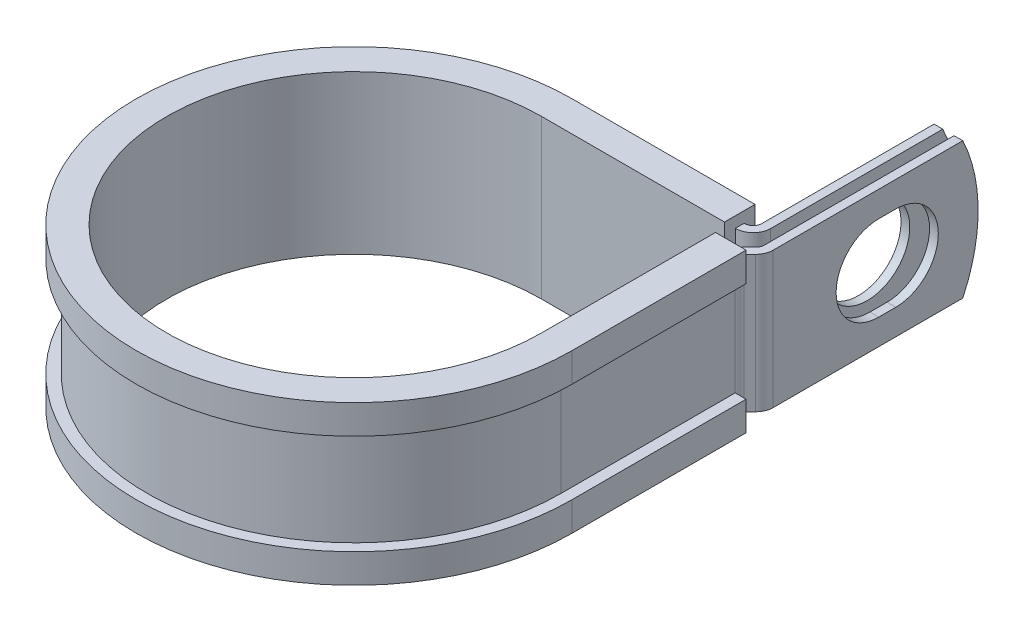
from build123d import *

# Parameters (mm, degrees)
EXTRUDE_THIN1_DEPTH = 9.525
SKETCH2_R           = 5.9436
CUT_EXTRUDE1_DEPTH  = 1.2192
CUT_EXTRUDE2_DEPTH  = 1.2192
CUT_EXTRUDE3_DEPTH  = 80.825829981


with BuildPart() as part:
    # Sketch1 → Extrude-Thin1 (new, symmetric)
    with BuildSketch(Plane(origin=(0, 0, 0), x_dir=(1, 0, 0), z_dir=(0, 1, 0))):
        with BuildLine():
            Line((29.6088698, 56.3372), (29.6088698, 27.7114))
            ThreePointArc((29.6088698, 27.7114), (29.516063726, 27.244832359), (29.251774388, 26.849295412))
            Line((29.251774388, 26.849295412), (28.425590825, 26.023111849))
            ThreePointArc((28.425590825, 26.023111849), (27.897012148, 25.232037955), (27.7114, 24.298902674))
            Line((27.7114, 24.298902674), (27.7114, 0))
            ThreePointArc((27.7114, 0), (-19.594918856, -19.594918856), (0, 27.7114))
            Line((0, 27.7114), (25.5956698, 27.7114))
            ThreePointArc((25.5956698, 27.7114), (27.319878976, 28.425590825), (28.0340698, 30.1498))
            Line((28.0340698, 30.1498), (28.0340698, 56.3372))
            Line((28.0340698, 56.3372), (26.8148698, 56.3372))
            Line((26.8148698, 56.3372), (26.8148698, 30.1498))
            ThreePointArc((26.8148698, 30.1498), (26.457774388, 29.287695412), (25.5956698, 28.9306))
            Line((25.5956698, 28.9306), (0, 28.9306))
            ThreePointArc((0, 28.9306), (-20.457023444, -20.457023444), (28.9306, 0))
            Line((28.9306, 0), (28.9306, 24.298902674))
            ThreePointArc((28.9306, 24.298902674), (29.023406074, 24.765470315), (29.287695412, 25.161007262))
            Line((29.287695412, 25.161007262), (30.113878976, 25.987190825))
            ThreePointArc((30.113878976, 25.987190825), (30.642457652, 26.778264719), (30.8280698, 27.7114))
            Line((30.8280698, 27.7114), (30.8280698, 56.3372))
            Line((30.8280698, 56.3372), (29.6088698, 56.3372))
        make_face()
    extrude(amount=EXTRUDE_THIN1_DEPTH, both=True)

    # Sketch2 → Cut-Extrude1 (cut)
    with BuildSketch(Plane.ZY.offset(-26.8148698)):
        with Locations((-43.6372, 0)):
            Circle(SKETCH2_R)
    extrude(amount=-CUT_EXTRUDE1_DEPTH, mode=Mode.SUBTRACT)

    # Sketch3 → Cut-Extrude2 (cut)
    with BuildSketch(Plane(origin=(30.8280698, 0, 0), x_dir=(0, 0, -1), z_dir=(1, 0, 0))):
        with BuildLine():
            Line((42.4434, 5.9436), (44.831, 5.9436))
            ThreePointArc((44.831, 5.9436), (50.7746, 0), (44.831, -5.9436))
            Line((44.831, -5.9436), (42.4434, -5.9436))
            ThreePointArc((42.4434, -5.9436), (36.4998, 0), (42.4434, 5.9436))
        make_face()
    extrude(amount=-CUT_EXTRUDE2_DEPTH, mode=Mode.SUBTRACT)

    # Sketch4 → Cut-Extrude3 (cut, through all)
    with BuildSketch(Plane.ZY.offset(-26.8148698)):
        with BuildLine():
            Line((-54.192663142, 9.525), (-56.3372, 9.525))
            Line((-56.3372, 9.525), (-56.3372, -2.73e-07))
            ThreePointArc((-56.3372, -2.73e-07), (-55.794438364, 4.881717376), (-54.192663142, 9.525))
        make_face()
        with BuildLine():
            ThreePointArc((-54.192663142, -9.525), (-55.794438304, -4.881717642), (-56.3372, -2.73e-07))
            Line((-56.3372, -2.73e-07), (-56.3372, -9.525))
            Line((-56.3372, -9.525), (-54.192663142, -9.525))
        make_face()
    extrude(amount=-CUT_EXTRUDE3_DEPTH, mode=Mode.SUBTRACT)

    # Sweep1: sweep along a path in Sketch6
    with BuildLine(Plane(origin=(0, 9.525, 0), x_dir=(1, 0, 0), z_dir=(0, 1, 0))) as sweep1_path:
        Line((26.1874, 24.298902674), (26.1874, 0))
        ThreePointArc((26.1874, 0), (-18.517288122, -18.517288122), (0, 26.1874))
        Line((0, 26.1874), (25.5448698, 26.1874))
    # Sketch5 → Sweep1 (sweep)
    with BuildSketch(Plane(origin=(0, 0, -24.298902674), x_dir=(-1, 0, 0), z_dir=(0, 0, -1))):
        Polygon((-28.9306, 9.525), (-27.7114, 9.525), (-27.7114, -9.525), (-28.9306, -9.525), (-28.9306, -6.985), (-30.4546, -6.985), (-30.4546, -11.049), (-26.1874, -11.049), (-26.1874, 11.049), (-30.4546, 11.049), (-30.4546, 6.985), (-28.9306, 6.985), align=None)
    sweep(path=sweep1_path.line)


solid = part.part
